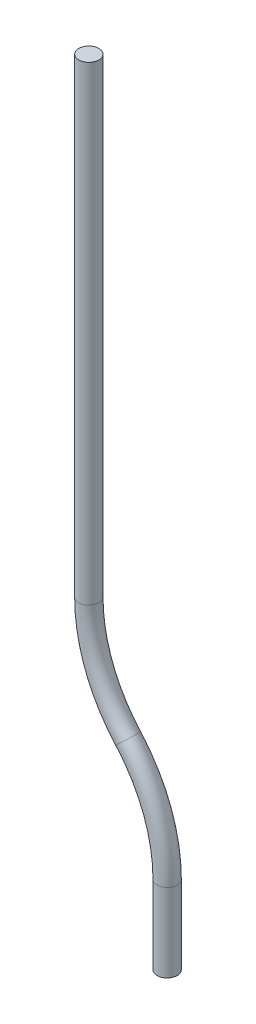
from build123d import *

# Parameters (mm, degrees)
SKETCH2_R = 3.25


with BuildPart() as part:
    # Sweep1: sweep along a path in Sketch1
    with BuildLine(Plane.XY) as sweep1_path:
        Line((0, 0), (0, 25.4))
        ThreePointArc((0, 25.4), (-3.282765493, 43.218529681), (-12.7, 58.697297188))
        ThreePointArc((-12.7, 58.697297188), (-22.117234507, 74.176064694), (-25.4, 91.994594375))
        Line((-25.4, 91.994594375), (-25.4, 244.394594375))
    # Sketch2 → Sweep1 (sweep)
    with BuildSketch(Plane(origin=(0, 0, 0), x_dir=(1, 0, 0), z_dir=(0, 1, 0))):
        Circle(SKETCH2_R)
    sweep(path=sweep1_path.line)


solid = part.part
